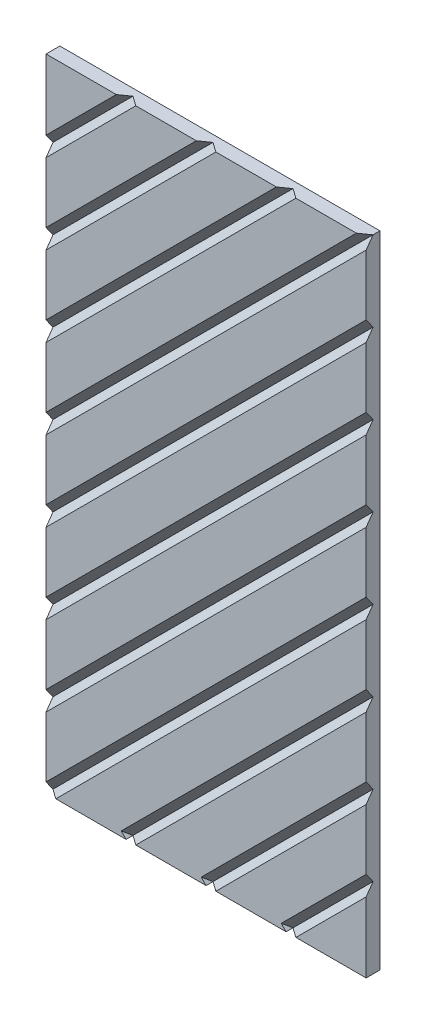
ISO-10303-21;
HEADER;
FILE_DESCRIPTION(('STEP AP214'),'2;1');
FILE_NAME('part.step','',(''),(''),'','','');
FILE_SCHEMA(('AUTOMOTIVE_DESIGN { 1 0 10303 214 1 1 1 1 }'));
ENDSEC;
DATA;
#1=APPLICATION_CONTEXT('core data for automotive mechanical design processes');
#2=APPLICATION_PROTOCOL_DEFINITION('international standard','automotive_design',2000,#1);
#3=PRODUCT_CONTEXT('',#1,'mechanical');
#4=PRODUCT('Part','Part','',(#3));
#5=PRODUCT_RELATED_PRODUCT_CATEGORY('part','',(#4));
#6=PRODUCT_DEFINITION_FORMATION('','',#4);
#7=PRODUCT_DEFINITION_CONTEXT('part definition',#1,'design');
#8=PRODUCT_DEFINITION('design','',#6,#7);
#9=PRODUCT_DEFINITION_SHAPE('','',#8);
#10=(LENGTH_UNIT() NAMED_UNIT(*) SI_UNIT(.MILLI.,.METRE.));
#11=(NAMED_UNIT(*) PLANE_ANGLE_UNIT() SI_UNIT($,.RADIAN.));
#12=(NAMED_UNIT(*) SI_UNIT($,.STERADIAN.) SOLID_ANGLE_UNIT());
#13=UNCERTAINTY_MEASURE_WITH_UNIT(LENGTH_MEASURE(1.E-05),#10,'distance_accuracy_value','');
#14=(GEOMETRIC_REPRESENTATION_CONTEXT(3) GLOBAL_UNCERTAINTY_ASSIGNED_CONTEXT((#13)) GLOBAL_UNIT_ASSIGNED_CONTEXT((#10,
#11,#12)) REPRESENTATION_CONTEXT('',''));
#15=CARTESIAN_POINT('',(0.,0.,0.));
#16=DIRECTION('',(0.,0.,1.));
#17=DIRECTION('',(1.,0.,0.));
#18=AXIS2_PLACEMENT_3D('',#15,#16,#17);
#19=CARTESIAN_POINT('',(0.,0.,25.));
#20=DIRECTION('',(0.,0.,1.));
#21=DIRECTION('',(1.,0.,0.));
#22=AXIS2_PLACEMENT_3D('',#19,#20,#21);
#23=PLANE('',#22);
#24=DIRECTION('',(0.707106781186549,0.707106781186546,0.));
#25=VECTOR('',#24,1.);
#26=CARTESIAN_POINT('',(371.338834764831,-371.338834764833,25.));
#27=LINE('',#26,#25);
#28=CARTESIAN_POINT('',(162.677669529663,-580.,25.));
#29=VERTEX_POINT('',#28);
#30=CARTESIAN_POINT('',(290.,-452.677669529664,25.));
#31=VERTEX_POINT('',#30);
#32=EDGE_CURVE('E299',#29,#31,#27,.T.);
#33=ORIENTED_EDGE('',*,*,#32,.F.);
#34=DIRECTION('',(1.,0.,0.));
#35=VECTOR('',#34,1.);
#36=CARTESIAN_POINT('',(-290.,-580.,25.));
#37=LINE('',#36,#35);
#38=CARTESIAN_POINT('',(290.,-580.,25.));
#39=VERTEX_POINT('',#38);
#40=EDGE_CURVE('E298',#29,#39,#37,.T.);
#41=ORIENTED_EDGE('',*,*,#40,.T.);
#42=DIRECTION('',(0.,1.,0.));
#43=VECTOR('',#42,1.);
#44=CARTESIAN_POINT('',(290.,580.,25.));
#45=LINE('',#44,#43);
#46=EDGE_CURVE('E467',#39,#31,#45,.T.);
#47=ORIENTED_EDGE('',*,*,#46,.T.);
#48=EDGE_LOOP('',(#33,#41,#47));
#49=FACE_BOUND('',#48,.T.);
#50=ADVANCED_FACE('F33',(#49),#23,.T.);
#51=DIRECTION('',(-0.707106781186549,-0.707106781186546,0.));
#52=VECTOR('',#51,1.);
#53=CARTESIAN_POINT('',(353.661165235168,-353.661165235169,25.));
#54=LINE('',#53,#52);
#55=CARTESIAN_POINT('',(290.,-417.322330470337,25.));
#56=VERTEX_POINT('',#55);
#57=CARTESIAN_POINT('',(136.161165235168,-571.161165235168,25.));
#58=VERTEX_POINT('',#57);
#59=EDGE_CURVE('E290',#56,#58,#54,.T.);
#60=ORIENTED_EDGE('',*,*,#59,.F.);
#61=CARTESIAN_POINT('',(290.,-307.677669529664,25.));
#62=VERTEX_POINT('',#61);
#63=EDGE_CURVE('E471',#56,#62,#45,.T.);
#64=ORIENTED_EDGE('',*,*,#63,.T.);
#65=DIRECTION('',(0.707106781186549,0.707106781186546,0.));
#66=VECTOR('',#65,1.);
#67=CARTESIAN_POINT('',(298.838834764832,-298.838834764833,25.));
#68=LINE('',#67,#66);
#69=CARTESIAN_POINT('',(17.6776695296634,-580.,25.));
#70=VERTEX_POINT('',#69);
#71=EDGE_CURVE('E310',#70,#62,#68,.T.);
#72=ORIENTED_EDGE('',*,*,#71,.F.);
#73=CARTESIAN_POINT('',(145.,-580.,25.));
#74=VERTEX_POINT('',#73);
#75=EDGE_CURVE('E558',#70,#74,#37,.T.);
#76=ORIENTED_EDGE('',*,*,#75,.T.);
#77=DIRECTION('',(-0.707106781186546,0.70710678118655,0.));
#78=VECTOR('',#77,1.);
#79=CARTESIAN_POINT('',(-217.5,-217.499999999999,25.));
#80=LINE('',#79,#78);
#81=EDGE_CURVE('E279',#74,#58,#80,.T.);
#82=ORIENTED_EDGE('',*,*,#81,.T.);
#83=EDGE_LOOP('',(#60,#64,#72,#76,#82));
#84=FACE_BOUND('',#83,.T.);
#85=ADVANCED_FACE('F665',(#84),#23,.T.);
#86=DIRECTION('',(-0.707106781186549,-0.707106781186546,0.));
#87=VECTOR('',#86,1.);
#88=CARTESIAN_POINT('',(281.161165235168,-281.161165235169,25.));
#89=LINE('',#88,#87);
#90=CARTESIAN_POINT('',(290.,-272.322330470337,25.));
#91=VERTEX_POINT('',#90);
#92=CARTESIAN_POINT('',(-8.83883476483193,-571.161165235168,25.));
#93=VERTEX_POINT('',#92);
#94=EDGE_CURVE('E308',#91,#93,#89,.T.);
#95=ORIENTED_EDGE('',*,*,#94,.F.);
#96=CARTESIAN_POINT('',(290.,-162.677669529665,25.));
#97=VERTEX_POINT('',#96);
#98=EDGE_CURVE('E636',#91,#97,#45,.T.);
#99=ORIENTED_EDGE('',*,*,#98,.T.);
#100=DIRECTION('',(0.707106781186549,0.707106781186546,0.));
#101=VECTOR('',#100,1.);
#102=CARTESIAN_POINT('',(226.338834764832,-226.338834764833,25.));
#103=LINE('',#102,#101);
#104=CARTESIAN_POINT('',(-127.322330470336,-580.,25.));
#105=VERTEX_POINT('',#104);
#106=EDGE_CURVE('E327',#105,#97,#103,.T.);
#107=ORIENTED_EDGE('',*,*,#106,.F.);
#108=CARTESIAN_POINT('',(-3.33066907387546E-13,-580.,25.));
#109=VERTEX_POINT('',#108);
#110=EDGE_CURVE('E466',#105,#109,#37,.T.);
#111=ORIENTED_EDGE('',*,*,#110,.T.);
#112=DIRECTION('',(-0.707106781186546,0.70710678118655,0.));
#113=VECTOR('',#112,1.);
#114=CARTESIAN_POINT('',(-290.,-289.999999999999,25.));
#115=LINE('',#114,#113);
#116=EDGE_CURVE('E316',#109,#93,#115,.T.);
#117=ORIENTED_EDGE('',*,*,#116,.T.);
#118=EDGE_LOOP('',(#95,#99,#107,#111,#117));
#119=FACE_BOUND('',#118,.T.);
#120=ADVANCED_FACE('F670',(#119),#23,.T.);
#121=DIRECTION('',(0.707106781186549,0.707106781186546,0.));
#122=VECTOR('',#121,1.);
#123=CARTESIAN_POINT('',(-353.661165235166,353.661165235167,25.));
#124=LINE('',#123,#122);
#125=CARTESIAN_POINT('',(-290.,417.322330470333,25.));
#126=VERTEX_POINT('',#125);
#127=CARTESIAN_POINT('',(-127.322330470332,580.,25.));
#128=VERTEX_POINT('',#127);
#129=EDGE_CURVE('E534',#126,#128,#124,.T.);
#130=ORIENTED_EDGE('',*,*,#129,.F.);
#131=DIRECTION('',(0.,-1.,0.));
#132=VECTOR('',#131,1.);
#133=CARTESIAN_POINT('',(-290.,580.,25.));
#134=LINE('',#133,#132);
#135=CARTESIAN_POINT('',(-290.,307.67766952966,25.));
#136=VERTEX_POINT('',#135);
#137=EDGE_CURVE('E460',#126,#136,#134,.T.);
#138=ORIENTED_EDGE('',*,*,#137,.T.);
#139=DIRECTION('',(-0.707106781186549,-0.707106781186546,0.));
#140=VECTOR('',#139,1.);
#141=CARTESIAN_POINT('',(-298.83883476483,298.838834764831,25.));
#142=LINE('',#141,#140);
#143=CARTESIAN_POINT('',(-17.6776695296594,580.,25.));
#144=VERTEX_POINT('',#143);
#145=EDGE_CURVE('E527',#144,#136,#142,.T.);
#146=ORIENTED_EDGE('',*,*,#145,.F.);
#147=DIRECTION('',(-1.,0.,0.));
#148=VECTOR('',#147,1.);
#149=CARTESIAN_POINT('',(-290.,580.,25.));
#150=LINE('',#149,#148);
#151=EDGE_CURVE('E577',#144,#128,#150,.T.);
#152=ORIENTED_EDGE('',*,*,#151,.T.);
#153=EDGE_LOOP('',(#130,#138,#146,#152));
#154=FACE_BOUND('',#153,.T.);
#155=ADVANCED_FACE('F898',(#154),#23,.T.);
#156=DIRECTION('',(0.707106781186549,0.707106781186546,0.));
#157=VECTOR('',#156,1.);
#158=CARTESIAN_POINT('',(-281.161165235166,281.161165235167,25.));
#159=LINE('',#158,#157);
#160=CARTESIAN_POINT('',(-290.,272.322330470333,25.));
#161=VERTEX_POINT('',#160);
#162=CARTESIAN_POINT('',(17.6776695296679,580.,25.));
#163=VERTEX_POINT('',#162);
#164=EDGE_CURVE('E530',#161,#163,#159,.T.);
#165=ORIENTED_EDGE('',*,*,#164,.F.);
#166=CARTESIAN_POINT('',(-290.,162.677669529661,25.));
#167=VERTEX_POINT('',#166);
#168=EDGE_CURVE('E595',#161,#167,#134,.T.);
#169=ORIENTED_EDGE('',*,*,#168,.T.);
#170=DIRECTION('',(-0.707106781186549,-0.707106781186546,0.));
#171=VECTOR('',#170,1.);
#172=CARTESIAN_POINT('',(-226.33883476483,226.338834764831,25.));
#173=LINE('',#172,#171);
#174=CARTESIAN_POINT('',(127.32233047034,580.,25.));
#175=VERTEX_POINT('',#174);
#176=EDGE_CURVE('E522',#175,#167,#173,.T.);
#177=ORIENTED_EDGE('',*,*,#176,.F.);
#178=EDGE_CURVE('E477',#175,#163,#150,.T.);
#179=ORIENTED_EDGE('',*,*,#178,.T.);
#180=EDGE_LOOP('',(#165,#169,#177,#179));
#181=FACE_BOUND('',#180,.T.);
#182=ADVANCED_FACE('F588',(#181),#23,.T.);
#183=DIRECTION('',(0.707106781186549,0.707106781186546,0.));
#184=VECTOR('',#183,1.);
#185=CARTESIAN_POINT('',(-208.661165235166,208.661165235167,25.));
#186=LINE('',#185,#184);
#187=CARTESIAN_POINT('',(-290.,127.322330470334,25.));
#188=VERTEX_POINT('',#187);
#189=CARTESIAN_POINT('',(162.677669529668,580.,25.));
#190=VERTEX_POINT('',#189);
#191=EDGE_CURVE('E525',#188,#190,#186,.T.);
#192=ORIENTED_EDGE('',*,*,#191,.F.);
#193=CARTESIAN_POINT('',(-290.,17.6776695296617,25.));
#194=VERTEX_POINT('',#193);
#195=EDGE_CURVE('E596',#188,#194,#134,.T.);
#196=ORIENTED_EDGE('',*,*,#195,.T.);
#197=DIRECTION('',(-0.707106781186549,-0.707106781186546,0.));
#198=VECTOR('',#197,1.);
#199=CARTESIAN_POINT('',(-153.83883476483,153.838834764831,25.));
#200=LINE('',#199,#198);
#201=CARTESIAN_POINT('',(272.32233047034,580.,25.));
#202=VERTEX_POINT('',#201);
#203=EDGE_CURVE('E517',#202,#194,#200,.T.);
#204=ORIENTED_EDGE('',*,*,#203,.F.);
#205=EDGE_CURVE('E473',#202,#190,#150,.T.);
#206=ORIENTED_EDGE('',*,*,#205,.T.);
#207=EDGE_LOOP('',(#192,#196,#204,#206));
#208=FACE_BOUND('',#207,.T.);
#209=ADVANCED_FACE('F696',(#208),#23,.T.);
#210=DIRECTION('',(0.707106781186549,0.707106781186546,0.));
#211=VECTOR('',#210,1.);
#212=CARTESIAN_POINT('',(-136.161165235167,136.161165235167,25.));
#213=LINE('',#212,#211);
#214=CARTESIAN_POINT('',(-290.,-17.6776695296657,25.));
#215=VERTEX_POINT('',#214);
#216=CARTESIAN_POINT('',(290.,562.322330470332,25.));
#217=VERTEX_POINT('',#216);
#218=EDGE_CURVE('E520',#215,#217,#213,.T.);
#219=ORIENTED_EDGE('',*,*,#218,.F.);
#220=CARTESIAN_POINT('',(-290.,-127.322330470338,25.));
#221=VERTEX_POINT('',#220);
#222=EDGE_CURVE('E597',#215,#221,#134,.T.);
#223=ORIENTED_EDGE('',*,*,#222,.T.);
#224=DIRECTION('',(-0.707106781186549,-0.707106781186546,0.));
#225=VECTOR('',#224,1.);
#226=CARTESIAN_POINT('',(-81.3388347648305,81.3388347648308,25.));
#227=LINE('',#226,#225);
#228=CARTESIAN_POINT('',(290.,452.67766952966,25.));
#229=VERTEX_POINT('',#228);
#230=EDGE_CURVE('E512',#229,#221,#227,.T.);
#231=ORIENTED_EDGE('',*,*,#230,.F.);
#232=EDGE_CURVE('E465',#229,#217,#45,.T.);
#233=ORIENTED_EDGE('',*,*,#232,.T.);
#234=EDGE_LOOP('',(#219,#223,#231,#233));
#235=FACE_BOUND('',#234,.T.);
#236=ADVANCED_FACE('F692',(#235),#23,.T.);
#237=DIRECTION('',(0.707106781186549,0.707106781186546,0.));
#238=VECTOR('',#237,1.);
#239=CARTESIAN_POINT('',(-63.6611652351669,63.6611652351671,25.));
#240=LINE('',#239,#238);
#241=CARTESIAN_POINT('',(-290.,-162.677669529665,25.));
#242=VERTEX_POINT('',#241);
#243=CARTESIAN_POINT('',(290.,417.322330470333,25.));
#244=VERTEX_POINT('',#243);
#245=EDGE_CURVE('E515',#242,#244,#240,.T.);
#246=ORIENTED_EDGE('',*,*,#245,.F.);
#247=CARTESIAN_POINT('',(-290.,-272.322330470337,25.));
#248=VERTEX_POINT('',#247);
#249=EDGE_CURVE('E602',#242,#248,#134,.T.);
#250=ORIENTED_EDGE('',*,*,#249,.T.);
#251=DIRECTION('',(-0.707106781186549,-0.707106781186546,0.));
#252=VECTOR('',#251,1.);
#253=CARTESIAN_POINT('',(-8.83883476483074,8.83883476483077,25.));
#254=LINE('',#253,#252);
#255=CARTESIAN_POINT('',(290.,307.67766952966,25.));
#256=VERTEX_POINT('',#255);
#257=EDGE_CURVE('E507',#256,#248,#254,.T.);
#258=ORIENTED_EDGE('',*,*,#257,.F.);
#259=EDGE_CURVE('E639',#256,#244,#45,.T.);
#260=ORIENTED_EDGE('',*,*,#259,.T.);
#261=EDGE_LOOP('',(#246,#250,#258,#260));
#262=FACE_BOUND('',#261,.T.);
#263=ADVANCED_FACE('F688',(#262),#23,.T.);
#264=DIRECTION('',(0.707106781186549,0.707106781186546,0.));
#265=VECTOR('',#264,1.);
#266=CARTESIAN_POINT('',(8.83883476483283,-8.83883476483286,25.));
#267=LINE('',#266,#265);
#268=CARTESIAN_POINT('',(-290.,-307.677669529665,25.));
#269=VERTEX_POINT('',#268);
#270=CARTESIAN_POINT('',(290.,272.322330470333,25.));
#271=VERTEX_POINT('',#270);
#272=EDGE_CURVE('E510',#269,#271,#267,.T.);
#273=ORIENTED_EDGE('',*,*,#272,.F.);
#274=CARTESIAN_POINT('',(-290.,-417.322330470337,25.));
#275=VERTEX_POINT('',#274);
#276=EDGE_CURVE('E607',#269,#275,#134,.T.);
#277=ORIENTED_EDGE('',*,*,#276,.T.);
#278=DIRECTION('',(-0.707106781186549,-0.707106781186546,0.));
#279=VECTOR('',#278,1.);
#280=CARTESIAN_POINT('',(63.661165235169,-63.6611652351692,25.));
#281=LINE('',#280,#279);
#282=CARTESIAN_POINT('',(290.,162.677669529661,25.));
#283=VERTEX_POINT('',#282);
#284=EDGE_CURVE('E502',#283,#275,#281,.T.);
#285=ORIENTED_EDGE('',*,*,#284,.F.);
#286=EDGE_CURVE('E637',#283,#271,#45,.T.);
#287=ORIENTED_EDGE('',*,*,#286,.T.);
#288=EDGE_LOOP('',(#273,#277,#285,#287));
#289=FACE_BOUND('',#288,.T.);
#290=ADVANCED_FACE('F645',(#289),#23,.T.);
#291=DIRECTION('',(0.707106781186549,0.707106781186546,0.));
#292=VECTOR('',#291,1.);
#293=CARTESIAN_POINT('',(81.3388347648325,-81.3388347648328,25.));
#294=LINE('',#293,#292);
#295=CARTESIAN_POINT('',(-290.,-452.677669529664,25.));
#296=VERTEX_POINT('',#295);
#297=CARTESIAN_POINT('',(290.,127.322330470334,25.));
#298=VERTEX_POINT('',#297);
#299=EDGE_CURVE('E505',#296,#298,#294,.T.);
#300=ORIENTED_EDGE('',*,*,#299,.F.);
#301=CARTESIAN_POINT('',(-290.,-562.322330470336,25.));
#302=VERTEX_POINT('',#301);
#303=EDGE_CURVE('E461',#296,#302,#134,.T.);
#304=ORIENTED_EDGE('',*,*,#303,.T.);
#305=DIRECTION('',(-0.707106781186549,-0.707106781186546,0.));
#306=VECTOR('',#305,1.);
#307=CARTESIAN_POINT('',(136.161165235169,-136.161165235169,25.));
#308=LINE('',#307,#306);
#309=CARTESIAN_POINT('',(290.,17.6776695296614,25.));
#310=VERTEX_POINT('',#309);
#311=EDGE_CURVE('E496',#310,#302,#308,.T.);
#312=ORIENTED_EDGE('',*,*,#311,.F.);
#313=EDGE_CURVE('E472',#310,#298,#45,.T.);
#314=ORIENTED_EDGE('',*,*,#313,.T.);
#315=EDGE_LOOP('',(#300,#304,#312,#314));
#316=FACE_BOUND('',#315,.T.);
#317=ADVANCED_FACE('F620',(#316),#23,.T.);
#318=DIRECTION('',(-0.707106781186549,-0.707106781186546,0.));
#319=VECTOR('',#318,1.);
#320=CARTESIAN_POINT('',(208.661165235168,-208.661165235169,25.));
#321=LINE('',#320,#319);
#322=CARTESIAN_POINT('',(290.,-127.322330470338,25.));
#323=VERTEX_POINT('',#322);
#324=CARTESIAN_POINT('',(-153.838834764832,-571.161165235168,25.));
#325=VERTEX_POINT('',#324);
#326=EDGE_CURVE('E325',#323,#325,#321,.T.);
#327=ORIENTED_EDGE('',*,*,#326,.F.);
#328=CARTESIAN_POINT('',(290.,-17.6776695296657,25.));
#329=VERTEX_POINT('',#328);
#330=EDGE_CURVE('E635',#323,#329,#45,.T.);
#331=ORIENTED_EDGE('',*,*,#330,.T.);
#332=DIRECTION('',(0.707106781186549,0.707106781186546,0.));
#333=VECTOR('',#332,1.);
#334=CARTESIAN_POINT('',(153.838834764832,-153.838834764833,25.));
#335=LINE('',#334,#333);
#336=CARTESIAN_POINT('',(-272.322330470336,-580.,25.));
#337=VERTEX_POINT('',#336);
#338=EDGE_CURVE('E499',#337,#329,#335,.T.);
#339=ORIENTED_EDGE('',*,*,#338,.F.);
#340=CARTESIAN_POINT('',(-145.,-580.,25.));
#341=VERTEX_POINT('',#340);
#342=EDGE_CURVE('E462',#337,#341,#37,.T.);
#343=ORIENTED_EDGE('',*,*,#342,.T.);
#344=DIRECTION('',(-0.707106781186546,0.70710678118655,0.));
#345=VECTOR('',#344,1.);
#346=CARTESIAN_POINT('',(-362.500000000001,-362.499999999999,25.));
#347=LINE('',#346,#345);
#348=EDGE_CURVE('E333',#341,#325,#347,.T.);
#349=ORIENTED_EDGE('',*,*,#348,.T.);
#350=EDGE_LOOP('',(#327,#331,#339,#343,#349));
#351=FACE_BOUND('',#350,.T.);
#352=ADVANCED_FACE('F633',(#351),#23,.T.);
#353=CARTESIAN_POINT('',(-290.,580.,25.));
#354=DIRECTION('',(1.,0.,0.));
#355=DIRECTION('',(0.,0.,-1.));
#356=AXIS2_PLACEMENT_3D('',#353,#354,#355);
#357=PLANE('',#356);
#358=ORIENTED_EDGE('',*,*,#137,.F.);
#359=DIRECTION('',(0.,0.816496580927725,-0.577350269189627));
#360=VECTOR('',#359,1.);
#361=CARTESIAN_POINT('',(-290.,525.774110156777,-51.6869888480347));
#362=LINE('',#361,#360);
#363=CARTESIAN_POINT('',(-290.,434.999999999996,12.5));
#364=VERTEX_POINT('',#363);
#365=EDGE_CURVE('E348',#126,#364,#362,.T.);
#366=ORIENTED_EDGE('',*,*,#365,.T.);
#367=DIRECTION('',(0.,0.816496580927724,0.577350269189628));
#368=VECTOR('',#367,1.);
#369=CARTESIAN_POINT('',(-290.,537.559223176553,85.0203221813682));
#370=LINE('',#369,#368);
#371=CARTESIAN_POINT('',(-290.,452.67766952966,25.));
#372=VERTEX_POINT('',#371);
#373=EDGE_CURVE('E342',#364,#372,#370,.T.);
#374=ORIENTED_EDGE('',*,*,#373,.T.);
#375=CARTESIAN_POINT('',(-290.,580.,25.));
#376=VERTEX_POINT('',#375);
#377=EDGE_CURVE('E457',#376,#372,#134,.T.);
#378=ORIENTED_EDGE('',*,*,#377,.F.);
#379=DIRECTION('',(0.,0.,-1.));
#380=VECTOR('',#379,1.);
#381=CARTESIAN_POINT('',(-290.,580.,25.));
#382=LINE('',#381,#380);
#383=CARTESIAN_POINT('',(-290.,580.,0.));
#384=VERTEX_POINT('',#383);
#385=EDGE_CURVE('E476',#376,#384,#382,.T.);
#386=ORIENTED_EDGE('',*,*,#385,.T.);
#387=DIRECTION('',(0.,-1.,0.));
#388=VECTOR('',#387,1.);
#389=CARTESIAN_POINT('',(-290.,580.,0.));
#390=LINE('',#389,#388);
#391=CARTESIAN_POINT('',(-290.,-580.,0.));
#392=VERTEX_POINT('',#391);
#393=EDGE_CURVE('E456',#384,#392,#390,.T.);
#394=ORIENTED_EDGE('',*,*,#393,.T.);
#395=DIRECTION('',(0.,0.,-1.));
#396=VECTOR('',#395,1.);
#397=CARTESIAN_POINT('',(-290.,-580.,25.));
#398=LINE('',#397,#396);
#399=CARTESIAN_POINT('',(-290.,-580.,12.5));
#400=VERTEX_POINT('',#399);
#401=EDGE_CURVE('E494',#400,#392,#398,.T.);
#402=ORIENTED_EDGE('',*,*,#401,.F.);
#403=DIRECTION('',(0.,0.816496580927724,0.577350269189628));
#404=VECTOR('',#403,1.);
#405=CARTESIAN_POINT('',(-290.,199.225889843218,563.495910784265));
#406=LINE('',#405,#404);
#407=EDGE_CURVE('E447',#400,#302,#406,.T.);
#408=ORIENTED_EDGE('',*,*,#407,.T.);
#409=ORIENTED_EDGE('',*,*,#303,.F.);
#410=DIRECTION('',(0.,0.816496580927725,-0.577350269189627));
#411=VECTOR('',#410,1.);
#412=CARTESIAN_POINT('',(-290.,235.774110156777,-461.808921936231));
#413=LINE('',#412,#411);
#414=CARTESIAN_POINT('',(-290.,-435.000000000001,12.5));
#415=VERTEX_POINT('',#414);
#416=EDGE_CURVE('E438',#296,#415,#413,.T.);
#417=ORIENTED_EDGE('',*,*,#416,.T.);
#418=DIRECTION('',(0.,0.816496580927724,0.577350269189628));
#419=VECTOR('',#418,1.);
#420=CARTESIAN_POINT('',(-290.,247.559223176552,495.142255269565));
#421=LINE('',#420,#419);
#422=EDGE_CURVE('E432',#415,#275,#421,.T.);
#423=ORIENTED_EDGE('',*,*,#422,.T.);
#424=ORIENTED_EDGE('',*,*,#276,.F.);
#425=DIRECTION('',(0.,0.816496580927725,-0.577350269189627));
#426=VECTOR('',#425,1.);
#427=CARTESIAN_POINT('',(-290.,284.10744349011,-393.455266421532));
#428=LINE('',#427,#426);
#429=CARTESIAN_POINT('',(-290.,-290.000000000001,12.5));
#430=VERTEX_POINT('',#429);
#431=EDGE_CURVE('E423',#269,#430,#428,.T.);
#432=ORIENTED_EDGE('',*,*,#431,.T.);
#433=DIRECTION('',(0.,0.816496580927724,0.577350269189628));
#434=VECTOR('',#433,1.);
#435=CARTESIAN_POINT('',(-290.,295.892556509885,426.788599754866));
#436=LINE('',#435,#434);
#437=EDGE_CURVE('E417',#430,#248,#436,.T.);
#438=ORIENTED_EDGE('',*,*,#437,.T.);
#439=ORIENTED_EDGE('',*,*,#249,.F.);
#440=DIRECTION('',(0.,0.816496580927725,-0.577350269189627));
#441=VECTOR('',#440,1.);
#442=CARTESIAN_POINT('',(-290.,332.440776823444,-325.101610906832));
#443=LINE('',#442,#441);
#444=CARTESIAN_POINT('',(-290.,-145.000000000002,12.5000000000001));
#445=VERTEX_POINT('',#444);
#446=EDGE_CURVE('E408',#242,#445,#443,.T.);
#447=ORIENTED_EDGE('',*,*,#446,.T.);
#448=DIRECTION('',(0.,0.816496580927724,0.577350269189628));
#449=VECTOR('',#448,1.);
#450=CARTESIAN_POINT('',(-290.,344.225889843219,358.434944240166));
#451=LINE('',#450,#449);
#452=EDGE_CURVE('E402',#445,#221,#451,.T.);
#453=ORIENTED_EDGE('',*,*,#452,.T.);
#454=ORIENTED_EDGE('',*,*,#222,.F.);
#455=DIRECTION('',(0.,0.816496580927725,-0.577350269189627));
#456=VECTOR('',#455,1.);
#457=CARTESIAN_POINT('',(-290.,380.774110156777,-256.747955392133));
#458=LINE('',#457,#456);
#459=CARTESIAN_POINT('',(-290.,-2.16493489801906E-12,12.5));
#460=VERTEX_POINT('',#459);
#461=EDGE_CURVE('E393',#215,#460,#458,.T.);
#462=ORIENTED_EDGE('',*,*,#461,.T.);
#463=DIRECTION('',(0.,0.816496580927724,0.577350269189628));
#464=VECTOR('',#463,1.);
#465=CARTESIAN_POINT('',(-290.,392.559223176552,290.081288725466));
#466=LINE('',#465,#464);
#467=EDGE_CURVE('E387',#460,#194,#466,.T.);
#468=ORIENTED_EDGE('',*,*,#467,.T.);
#469=ORIENTED_EDGE('',*,*,#195,.F.);
#470=DIRECTION('',(0.,0.816496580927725,-0.577350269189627));
#471=VECTOR('',#470,1.);
#472=CARTESIAN_POINT('',(-290.,429.107443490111,-188.394299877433));
#473=LINE('',#472,#471);
#474=CARTESIAN_POINT('',(-290.,144.999999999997,12.5));
#475=VERTEX_POINT('',#474);
#476=EDGE_CURVE('E378',#188,#475,#473,.T.);
#477=ORIENTED_EDGE('',*,*,#476,.T.);
#478=DIRECTION('',(0.,0.816496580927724,0.577350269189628));
#479=VECTOR('',#478,1.);
#480=CARTESIAN_POINT('',(-290.,440.892556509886,221.727633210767));
#481=LINE('',#480,#479);
#482=EDGE_CURVE('E372',#475,#167,#481,.T.);
#483=ORIENTED_EDGE('',*,*,#482,.T.);
#484=ORIENTED_EDGE('',*,*,#168,.F.);
#485=DIRECTION('',(0.,0.816496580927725,-0.577350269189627));
#486=VECTOR('',#485,1.);
#487=CARTESIAN_POINT('',(-290.,477.440776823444,-120.040644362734));
#488=LINE('',#487,#486);
#489=CARTESIAN_POINT('',(-290.,289.999999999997,12.5));
#490=VERTEX_POINT('',#489);
#491=EDGE_CURVE('E363',#161,#490,#488,.T.);
#492=ORIENTED_EDGE('',*,*,#491,.T.);
#493=DIRECTION('',(0.,0.816496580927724,0.577350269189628));
#494=VECTOR('',#493,1.);
#495=CARTESIAN_POINT('',(-290.,489.225889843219,153.373977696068));
#496=LINE('',#495,#494);
#497=EDGE_CURVE('E357',#490,#136,#496,.T.);
#498=ORIENTED_EDGE('',*,*,#497,.T.);
#499=EDGE_LOOP('',(#358,#366,#374,#378,#386,#394,#402,#408,#409,#417,#423,#424,#432,#438,#439,
#447,#453,#454,#462,#468,#469,#477,#483,#484,#492,#498));
#500=FACE_BOUND('',#499,.T.);
#501=ADVANCED_FACE('F35',(#500),#357,.F.);
#502=CARTESIAN_POINT('',(-290.,-580.,25.));
#503=DIRECTION('',(0.,1.,0.));
#504=DIRECTION('',(0.,0.,1.));
#505=AXIS2_PLACEMENT_3D('',#502,#503,#504);
#506=PLANE('',#505);
#507=ORIENTED_EDGE('',*,*,#40,.F.);
#508=DIRECTION('',(-0.816496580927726,0.,-0.577350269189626));
#509=VECTOR('',#508,1.);
#510=CARTESIAN_POINT('',(-139.107443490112,-580.,-188.394299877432));
#511=LINE('',#510,#509);
#512=CARTESIAN_POINT('',(145.,-580.,12.5));
#513=VERTEX_POINT('',#512);
#514=EDGE_CURVE('E286',#29,#513,#511,.T.);
#515=ORIENTED_EDGE('',*,*,#514,.T.);
#516=DIRECTION('',(0.,0.,-1.));
#517=VECTOR('',#516,1.);
#518=CARTESIAN_POINT('',(145.,-580.,25.0000000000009));
#519=LINE('',#518,#517);
#520=EDGE_CURVE('E11',#74,#513,#519,.T.);
#521=ORIENTED_EDGE('',*,*,#520,.F.);
#522=ORIENTED_EDGE('',*,*,#75,.F.);
#523=DIRECTION('',(-0.816496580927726,0.,-0.577350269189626));
#524=VECTOR('',#523,1.);
#525=CARTESIAN_POINT('',(-187.440776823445,-580.,-120.040644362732));
#526=LINE('',#525,#524);
#527=CARTESIAN_POINT('',(-1.11022302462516E-13,-580.,12.5));
#528=VERTEX_POINT('',#527);
#529=EDGE_CURVE('E313',#70,#528,#526,.T.);
#530=ORIENTED_EDGE('',*,*,#529,.T.);
#531=DIRECTION('',(0.,0.,-1.));
#532=VECTOR('',#531,1.);
#533=CARTESIAN_POINT('',(-3.33066907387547E-13,-580.,25.0000000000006));
#534=LINE('',#533,#532);
#535=EDGE_CURVE('E550',#109,#528,#534,.T.);
#536=ORIENTED_EDGE('',*,*,#535,.F.);
#537=ORIENTED_EDGE('',*,*,#110,.F.);
#538=DIRECTION('',(-0.816496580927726,0.,-0.577350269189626));
#539=VECTOR('',#538,1.);
#540=CARTESIAN_POINT('',(-235.774110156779,-580.,-51.6869888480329));
#541=LINE('',#540,#539);
#542=CARTESIAN_POINT('',(-145.,-580.,12.5));
#543=VERTEX_POINT('',#542);
#544=EDGE_CURVE('E330',#105,#543,#541,.T.);
#545=ORIENTED_EDGE('',*,*,#544,.T.);
#546=DIRECTION('',(0.,0.,-1.));
#547=VECTOR('',#546,1.);
#548=CARTESIAN_POINT('',(-145.,-580.,25.0000000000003));
#549=LINE('',#548,#547);
#550=EDGE_CURVE('E542',#341,#543,#549,.T.);
#551=ORIENTED_EDGE('',*,*,#550,.F.);
#552=ORIENTED_EDGE('',*,*,#342,.F.);
#553=DIRECTION('',(-0.816496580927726,0.,-0.577350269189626));
#554=VECTOR('',#553,1.);
#555=CARTESIAN_POINT('',(-284.107443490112,-580.,16.6666666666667));
#556=LINE('',#555,#554);
#557=EDGE_CURVE('E453',#337,#400,#556,.T.);
#558=ORIENTED_EDGE('',*,*,#557,.T.);
#559=ORIENTED_EDGE('',*,*,#401,.T.);
#560=DIRECTION('',(1.,0.,0.));
#561=VECTOR('',#560,1.);
#562=CARTESIAN_POINT('',(-290.,-580.,0.));
#563=LINE('',#562,#561);
#564=CARTESIAN_POINT('',(290.,-580.,0.));
#565=VERTEX_POINT('',#564);
#566=EDGE_CURVE('E480',#392,#565,#563,.T.);
#567=ORIENTED_EDGE('',*,*,#566,.T.);
#568=DIRECTION('',(0.,0.,-1.));
#569=VECTOR('',#568,1.);
#570=CARTESIAN_POINT('',(290.,-580.,25.));
#571=LINE('',#570,#569);
#572=EDGE_CURVE('E491',#39,#565,#571,.T.);
#573=ORIENTED_EDGE('',*,*,#572,.F.);
#574=EDGE_LOOP('',(#507,#515,#521,#522,#530,#536,#537,#545,#551,#552,#558,#559,#567,#573));
#575=FACE_BOUND('',#574,.T.);
#576=ADVANCED_FACE('F296',(#575),#506,.F.);
#577=CARTESIAN_POINT('',(290.,580.,25.));
#578=DIRECTION('',(-1.,0.,0.));
#579=DIRECTION('',(0.,0.,1.));
#580=AXIS2_PLACEMENT_3D('',#577,#578,#579);
#581=PLANE('',#580);
#582=DIRECTION('',(0.,-0.816496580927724,-0.577350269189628));
#583=VECTOR('',#582,1.);
#584=CARTESIAN_POINT('',(290.,247.559223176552,495.142255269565));
#585=LINE('',#584,#583);
#586=CARTESIAN_POINT('',(290.,-435.,12.5));
#587=VERTEX_POINT('',#586);
#588=EDGE_CURVE('E552',#56,#587,#585,.T.);
#589=ORIENTED_EDGE('',*,*,#588,.T.);
#590=DIRECTION('',(0.,-0.816496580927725,0.577350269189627));
#591=VECTOR('',#590,1.);
#592=CARTESIAN_POINT('',(290.,235.774110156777,-461.808921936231));
#593=LINE('',#592,#591);
#594=EDGE_CURVE('E41',#587,#31,#593,.T.);
#595=ORIENTED_EDGE('',*,*,#594,.T.);
#596=ORIENTED_EDGE('',*,*,#46,.F.);
#597=ORIENTED_EDGE('',*,*,#572,.T.);
#598=DIRECTION('',(0.,1.,0.));
#599=VECTOR('',#598,1.);
#600=CARTESIAN_POINT('',(290.,580.,0.));
#601=LINE('',#600,#599);
#602=CARTESIAN_POINT('',(290.,580.,0.));
#603=VERTEX_POINT('',#602);
#604=EDGE_CURVE('E482',#565,#603,#601,.T.);
#605=ORIENTED_EDGE('',*,*,#604,.T.);
#606=DIRECTION('',(0.,0.,-1.));
#607=VECTOR('',#606,1.);
#608=CARTESIAN_POINT('',(290.,580.,25.));
#609=LINE('',#608,#607);
#610=CARTESIAN_POINT('',(290.000000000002,579.999999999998,12.5));
#611=VERTEX_POINT('',#610);
#612=EDGE_CURVE('E489',#611,#603,#609,.T.);
#613=ORIENTED_EDGE('',*,*,#612,.F.);
#614=DIRECTION('',(0.,-0.816496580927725,0.577350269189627));
#615=VECTOR('',#614,1.);
#616=CARTESIAN_POINT('',(290.,574.107443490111,16.6666666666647));
#617=LINE('',#616,#615);
#618=EDGE_CURVE('E390',#611,#217,#617,.T.);
#619=ORIENTED_EDGE('',*,*,#618,.T.);
#620=ORIENTED_EDGE('',*,*,#232,.F.);
#621=DIRECTION('',(0.,-0.816496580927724,-0.577350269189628));
#622=VECTOR('',#621,1.);
#623=CARTESIAN_POINT('',(290.,537.559223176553,85.020322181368));
#624=LINE('',#623,#622);
#625=CARTESIAN_POINT('',(290.,434.999999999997,12.5));
#626=VERTEX_POINT('',#625);
#627=EDGE_CURVE('E399',#229,#626,#624,.T.);
#628=ORIENTED_EDGE('',*,*,#627,.T.);
#629=DIRECTION('',(0.,-0.816496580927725,0.577350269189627));
#630=VECTOR('',#629,1.);
#631=CARTESIAN_POINT('',(290.,525.774110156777,-51.6869888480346));
#632=LINE('',#631,#630);
#633=EDGE_CURVE('E405',#626,#244,#632,.T.);
#634=ORIENTED_EDGE('',*,*,#633,.T.);
#635=ORIENTED_EDGE('',*,*,#259,.F.);
#636=DIRECTION('',(0.,-0.816496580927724,-0.577350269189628));
#637=VECTOR('',#636,1.);
#638=CARTESIAN_POINT('',(290.,489.225889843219,153.373977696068));
#639=LINE('',#638,#637);
#640=CARTESIAN_POINT('',(290.,289.999999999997,12.5));
#641=VERTEX_POINT('',#640);
#642=EDGE_CURVE('E414',#256,#641,#639,.T.);
#643=ORIENTED_EDGE('',*,*,#642,.T.);
#644=DIRECTION('',(0.,-0.816496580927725,0.577350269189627));
#645=VECTOR('',#644,1.);
#646=CARTESIAN_POINT('',(290.,477.440776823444,-120.040644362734));
#647=LINE('',#646,#645);
#648=EDGE_CURVE('E420',#641,#271,#647,.T.);
#649=ORIENTED_EDGE('',*,*,#648,.T.);
#650=ORIENTED_EDGE('',*,*,#286,.F.);
#651=DIRECTION('',(0.,-0.816496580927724,-0.577350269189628));
#652=VECTOR('',#651,1.);
#653=CARTESIAN_POINT('',(290.,440.892556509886,221.727633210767));
#654=LINE('',#653,#652);
#655=CARTESIAN_POINT('',(290.,144.999999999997,12.5));
#656=VERTEX_POINT('',#655);
#657=EDGE_CURVE('E429',#283,#656,#654,.T.);
#658=ORIENTED_EDGE('',*,*,#657,.T.);
#659=DIRECTION('',(0.,-0.816496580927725,0.577350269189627));
#660=VECTOR('',#659,1.);
#661=CARTESIAN_POINT('',(290.,429.107443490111,-188.394299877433));
#662=LINE('',#661,#660);
#663=EDGE_CURVE('E435',#656,#298,#662,.T.);
#664=ORIENTED_EDGE('',*,*,#663,.T.);
#665=ORIENTED_EDGE('',*,*,#313,.F.);
#666=DIRECTION('',(0.,-0.816496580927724,-0.577350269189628));
#667=VECTOR('',#666,1.);
#668=CARTESIAN_POINT('',(290.,392.559223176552,290.081288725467));
#669=LINE('',#668,#667);
#670=CARTESIAN_POINT('',(290.,-2.02615701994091E-12,12.5));
#671=VERTEX_POINT('',#670);
#672=EDGE_CURVE('E444',#310,#671,#669,.T.);
#673=ORIENTED_EDGE('',*,*,#672,.T.);
#674=DIRECTION('',(0.,-0.816496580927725,0.577350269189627));
#675=VECTOR('',#674,1.);
#676=CARTESIAN_POINT('',(290.,380.774110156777,-256.747955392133));
#677=LINE('',#676,#675);
#678=EDGE_CURVE('E450',#671,#329,#677,.T.);
#679=ORIENTED_EDGE('',*,*,#678,.T.);
#680=ORIENTED_EDGE('',*,*,#330,.F.);
#681=DIRECTION('',(0.,-0.816496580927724,-0.577350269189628));
#682=VECTOR('',#681,1.);
#683=CARTESIAN_POINT('',(290.,344.225889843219,358.434944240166));
#684=LINE('',#683,#682);
#685=CARTESIAN_POINT('',(290.,-145.000000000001,12.5));
#686=VERTEX_POINT('',#685);
#687=EDGE_CURVE('E536',#323,#686,#684,.T.);
#688=ORIENTED_EDGE('',*,*,#687,.T.);
#689=DIRECTION('',(0.,-0.816496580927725,0.577350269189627));
#690=VECTOR('',#689,1.);
#691=CARTESIAN_POINT('',(290.,332.440776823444,-325.101610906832));
#692=LINE('',#691,#690);
#693=EDGE_CURVE('E539',#686,#97,#692,.T.);
#694=ORIENTED_EDGE('',*,*,#693,.T.);
#695=ORIENTED_EDGE('',*,*,#98,.F.);
#696=DIRECTION('',(0.,-0.816496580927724,-0.577350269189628));
#697=VECTOR('',#696,1.);
#698=CARTESIAN_POINT('',(290.,295.892556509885,426.788599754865));
#699=LINE('',#698,#697);
#700=CARTESIAN_POINT('',(290.,-290.000000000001,12.5));
#701=VERTEX_POINT('',#700);
#702=EDGE_CURVE('E544',#91,#701,#699,.T.);
#703=ORIENTED_EDGE('',*,*,#702,.T.);
#704=DIRECTION('',(0.,-0.816496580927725,0.577350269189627));
#705=VECTOR('',#704,1.);
#706=CARTESIAN_POINT('',(290.,284.107443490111,-393.455266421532));
#707=LINE('',#706,#705);
#708=EDGE_CURVE('E547',#701,#62,#707,.T.);
#709=ORIENTED_EDGE('',*,*,#708,.T.);
#710=ORIENTED_EDGE('',*,*,#63,.F.);
#711=EDGE_LOOP('',(#589,#595,#596,#597,#605,#613,#619,#620,#628,#634,#635,#643,#649,#650,#658,
#664,#665,#673,#679,#680,#688,#694,#695,#703,#709,#710));
#712=FACE_BOUND('',#711,.T.);
#713=ADVANCED_FACE('F555',(#712),#581,.F.);
#714=CARTESIAN_POINT('',(-290.,580.,25.));
#715=DIRECTION('',(0.,-1.,0.));
#716=DIRECTION('',(0.,0.,-1.));
#717=AXIS2_PLACEMENT_3D('',#714,#715,#716);
#718=PLANE('',#717);
#719=DIRECTION('',(0.816496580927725,0.,-0.577350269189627));
#720=VECTOR('',#719,1.);
#721=CARTESIAN_POINT('',(-247.559223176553,580.,85.0203221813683));
#722=LINE('',#721,#720);
#723=CARTESIAN_POINT('',(-162.677669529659,580.,25.));
#724=VERTEX_POINT('',#723);
#725=CARTESIAN_POINT('',(-144.999999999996,580.,12.5));
#726=VERTEX_POINT('',#725);
#727=EDGE_CURVE('E339',#724,#726,#722,.T.);
#728=ORIENTED_EDGE('',*,*,#727,.T.);
#729=DIRECTION('',(0.816496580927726,0.,0.577350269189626));
#730=VECTOR('',#729,1.);
#731=CARTESIAN_POINT('',(-235.774110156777,580.,-51.6869888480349));
#732=LINE('',#731,#730);
#733=EDGE_CURVE('E345',#726,#128,#732,.T.);
#734=ORIENTED_EDGE('',*,*,#733,.T.);
#735=ORIENTED_EDGE('',*,*,#151,.F.);
#736=DIRECTION('',(0.816496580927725,0.,-0.577350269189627));
#737=VECTOR('',#736,1.);
#738=CARTESIAN_POINT('',(-199.225889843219,580.,153.373977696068));
#739=LINE('',#738,#737);
#740=CARTESIAN_POINT('',(4.28823643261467E-12,580.,12.5));
#741=VERTEX_POINT('',#740);
#742=EDGE_CURVE('E354',#144,#741,#739,.T.);
#743=ORIENTED_EDGE('',*,*,#742,.T.);
#744=DIRECTION('',(0.816496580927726,0.,0.577350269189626));
#745=VECTOR('',#744,1.);
#746=CARTESIAN_POINT('',(-187.440776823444,580.,-120.040644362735));
#747=LINE('',#746,#745);
#748=EDGE_CURVE('E360',#741,#163,#747,.T.);
#749=ORIENTED_EDGE('',*,*,#748,.T.);
#750=ORIENTED_EDGE('',*,*,#178,.F.);
#751=DIRECTION('',(0.816496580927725,0.,-0.577350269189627));
#752=VECTOR('',#751,1.);
#753=CARTESIAN_POINT('',(-150.892556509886,580.,221.727633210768));
#754=LINE('',#753,#752);
#755=CARTESIAN_POINT('',(145.000000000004,580.,12.5));
#756=VERTEX_POINT('',#755);
#757=EDGE_CURVE('E369',#175,#756,#754,.T.);
#758=ORIENTED_EDGE('',*,*,#757,.T.);
#759=DIRECTION('',(0.816496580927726,0.,0.577350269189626));
#760=VECTOR('',#759,1.);
#761=CARTESIAN_POINT('',(-139.107443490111,580.,-188.394299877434));
#762=LINE('',#761,#760);
#763=EDGE_CURVE('E375',#756,#190,#762,.T.);
#764=ORIENTED_EDGE('',*,*,#763,.T.);
#765=ORIENTED_EDGE('',*,*,#205,.F.);
#766=DIRECTION('',(0.816496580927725,0.,-0.577350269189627));
#767=VECTOR('',#766,1.);
#768=CARTESIAN_POINT('',(-102.559223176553,580.,290.081288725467));
#769=LINE('',#768,#767);
#770=EDGE_CURVE('E384',#202,#611,#769,.T.);
#771=ORIENTED_EDGE('',*,*,#770,.T.);
#772=ORIENTED_EDGE('',*,*,#612,.T.);
#773=DIRECTION('',(-1.,0.,0.));
#774=VECTOR('',#773,1.);
#775=CARTESIAN_POINT('',(-290.,580.,0.));
#776=LINE('',#775,#774);
#777=EDGE_CURVE('E485',#603,#384,#776,.T.);
#778=ORIENTED_EDGE('',*,*,#777,.T.);
#779=ORIENTED_EDGE('',*,*,#385,.F.);
#780=EDGE_CURVE('E470',#724,#376,#150,.T.);
#781=ORIENTED_EDGE('',*,*,#780,.F.);
#782=EDGE_LOOP('',(#728,#734,#735,#743,#749,#750,#758,#764,#765,#771,#772,#778,#779,#781));
#783=FACE_BOUND('',#782,.T.);
#784=ADVANCED_FACE('F568',(#783),#718,.F.);
#785=DIRECTION('',(-0.707106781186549,-0.707106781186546,0.));
#786=VECTOR('',#785,1.);
#787=CARTESIAN_POINT('',(-371.338834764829,371.338834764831,25.));
#788=LINE('',#787,#786);
#789=EDGE_CURVE('E532',#724,#372,#788,.T.);
#790=ORIENTED_EDGE('',*,*,#789,.F.);
#791=ORIENTED_EDGE('',*,*,#780,.T.);
#792=ORIENTED_EDGE('',*,*,#377,.T.);
#793=EDGE_LOOP('',(#790,#791,#792));
#794=FACE_BOUND('',#793,.T.);
#795=ADVANCED_FACE('F576',(#794),#23,.T.);
#796=CARTESIAN_POINT('',(0.,0.,0.));
#797=DIRECTION('',(0.,0.,1.));
#798=DIRECTION('',(1.,0.,0.));
#799=AXIS2_PLACEMENT_3D('',#796,#797,#798);
#800=PLANE('',#799);
#801=ORIENTED_EDGE('',*,*,#393,.F.);
#802=ORIENTED_EDGE('',*,*,#777,.F.);
#803=ORIENTED_EDGE('',*,*,#604,.F.);
#804=ORIENTED_EDGE('',*,*,#566,.F.);
#805=EDGE_LOOP('',(#801,#802,#803,#804));
#806=FACE_BOUND('',#805,.T.);
#807=ADVANCED_FACE('F565',(#806),#800,.F.);
#808=CARTESIAN_POINT('',(599.358108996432,270.641891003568,39.8765002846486));
#809=DIRECTION('',(0.499999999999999,-0.500000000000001,-0.707106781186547));
#810=DIRECTION('',(0.,0.816496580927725,-0.577350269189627));
#811=AXIS2_PLACEMENT_3D('',#808,#809,#810);
#812=PLANE('',#811);
#813=ORIENTED_EDGE('',*,*,#338,.T.);
#814=ORIENTED_EDGE('',*,*,#678,.F.);
#815=DIRECTION('',(-0.707106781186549,-0.707106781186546,0.));
#816=VECTOR('',#815,1.);
#817=CARTESIAN_POINT('',(580.000000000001,289.999999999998,12.5));
#818=LINE('',#817,#816);
#819=EDGE_CURVE('E441',#671,#400,#818,.T.);
#820=ORIENTED_EDGE('',*,*,#819,.T.);
#821=ORIENTED_EDGE('',*,*,#557,.F.);
#822=EDGE_LOOP('',(#813,#814,#820,#821));
#823=FACE_BOUND('',#822,.T.);
#824=ADVANCED_FACE('F630',(#823),#812,.F.);
#825=CARTESIAN_POINT('',(580.000000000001,289.999999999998,12.5));
#826=DIRECTION('',(-0.5,0.500000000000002,-0.707106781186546));
#827=DIRECTION('',(0.,0.816496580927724,0.577350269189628));
#828=AXIS2_PLACEMENT_3D('',#825,#826,#827);
#829=PLANE('',#828);
#830=ORIENTED_EDGE('',*,*,#819,.F.);
#831=ORIENTED_EDGE('',*,*,#672,.F.);
#832=ORIENTED_EDGE('',*,*,#311,.T.);
#833=ORIENTED_EDGE('',*,*,#407,.F.);
#834=EDGE_LOOP('',(#830,#831,#832,#833));
#835=FACE_BOUND('',#834,.T.);
#836=ADVANCED_FACE('F625',(#835),#829,.F.);
#837=CARTESIAN_POINT('',(526.858108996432,343.141891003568,39.8765002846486));
#838=DIRECTION('',(0.5,-0.500000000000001,-0.707106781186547));
#839=DIRECTION('',(0.,0.816496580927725,-0.577350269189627));
#840=AXIS2_PLACEMENT_3D('',#837,#838,#839);
#841=PLANE('',#840);
#842=ORIENTED_EDGE('',*,*,#299,.T.);
#843=ORIENTED_EDGE('',*,*,#663,.F.);
#844=DIRECTION('',(-0.707106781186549,-0.707106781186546,0.));
#845=VECTOR('',#844,1.);
#846=CARTESIAN_POINT('',(507.500000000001,362.499999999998,12.5));
#847=LINE('',#846,#845);
#848=EDGE_CURVE('E426',#656,#415,#847,.T.);
#849=ORIENTED_EDGE('',*,*,#848,.T.);
#850=ORIENTED_EDGE('',*,*,#416,.F.);
#851=EDGE_LOOP('',(#842,#843,#849,#850));
#852=FACE_BOUND('',#851,.T.);
#853=ADVANCED_FACE('F655',(#852),#841,.F.);
#854=CARTESIAN_POINT('',(507.500000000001,362.499999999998,12.5));
#855=DIRECTION('',(-0.5,0.500000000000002,-0.707106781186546));
#856=DIRECTION('',(0.,0.816496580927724,0.577350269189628));
#857=AXIS2_PLACEMENT_3D('',#854,#855,#856);
#858=PLANE('',#857);
#859=ORIENTED_EDGE('',*,*,#848,.F.);
#860=ORIENTED_EDGE('',*,*,#657,.F.);
#861=ORIENTED_EDGE('',*,*,#284,.T.);
#862=ORIENTED_EDGE('',*,*,#422,.F.);
#863=EDGE_LOOP('',(#859,#860,#861,#862));
#864=FACE_BOUND('',#863,.T.);
#865=ADVANCED_FACE('F653',(#864),#858,.F.);
#866=CARTESIAN_POINT('',(454.358108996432,415.641891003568,39.8765002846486));
#867=DIRECTION('',(0.5,-0.500000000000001,-0.707106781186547));
#868=DIRECTION('',(0.,0.816496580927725,-0.577350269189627));
#869=AXIS2_PLACEMENT_3D('',#866,#867,#868);
#870=PLANE('',#869);
#871=ORIENTED_EDGE('',*,*,#272,.T.);
#872=ORIENTED_EDGE('',*,*,#648,.F.);
#873=DIRECTION('',(-0.707106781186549,-0.707106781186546,0.));
#874=VECTOR('',#873,1.);
#875=CARTESIAN_POINT('',(435.000000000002,434.999999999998,12.5));
#876=LINE('',#875,#874);
#877=EDGE_CURVE('E411',#641,#430,#876,.T.);
#878=ORIENTED_EDGE('',*,*,#877,.T.);
#879=ORIENTED_EDGE('',*,*,#431,.F.);
#880=EDGE_LOOP('',(#871,#872,#878,#879));
#881=FACE_BOUND('',#880,.T.);
#882=ADVANCED_FACE('F648',(#881),#870,.F.);
#883=CARTESIAN_POINT('',(435.000000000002,434.999999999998,12.5));
#884=DIRECTION('',(-0.5,0.500000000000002,-0.707106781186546));
#885=DIRECTION('',(0.,0.816496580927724,0.577350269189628));
#886=AXIS2_PLACEMENT_3D('',#883,#884,#885);
#887=PLANE('',#886);
#888=ORIENTED_EDGE('',*,*,#877,.F.);
#889=ORIENTED_EDGE('',*,*,#642,.F.);
#890=ORIENTED_EDGE('',*,*,#257,.T.);
#891=ORIENTED_EDGE('',*,*,#437,.F.);
#892=EDGE_LOOP('',(#888,#889,#890,#891));
#893=FACE_BOUND('',#892,.T.);
#894=ADVANCED_FACE('F650',(#893),#887,.F.);
#895=CARTESIAN_POINT('',(381.858108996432,488.141891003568,39.8765002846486));
#896=DIRECTION('',(0.5,-0.500000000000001,-0.707106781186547));
#897=DIRECTION('',(0.,0.816496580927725,-0.577350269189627));
#898=AXIS2_PLACEMENT_3D('',#895,#896,#897);
#899=PLANE('',#898);
#900=ORIENTED_EDGE('',*,*,#245,.T.);
#901=ORIENTED_EDGE('',*,*,#633,.F.);
#902=DIRECTION('',(-0.707106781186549,-0.707106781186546,0.));
#903=VECTOR('',#902,1.);
#904=CARTESIAN_POINT('',(362.500000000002,507.499999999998,12.5));
#905=LINE('',#904,#903);
#906=EDGE_CURVE('E396',#626,#445,#905,.T.);
#907=ORIENTED_EDGE('',*,*,#906,.T.);
#908=ORIENTED_EDGE('',*,*,#446,.F.);
#909=EDGE_LOOP('',(#900,#901,#907,#908));
#910=FACE_BOUND('',#909,.T.);
#911=ADVANCED_FACE('F698',(#910),#899,.F.);
#912=CARTESIAN_POINT('',(362.500000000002,507.499999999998,12.5));
#913=DIRECTION('',(-0.5,0.500000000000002,-0.707106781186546));
#914=DIRECTION('',(0.,0.816496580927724,0.577350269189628));
#915=AXIS2_PLACEMENT_3D('',#912,#913,#914);
#916=PLANE('',#915);
#917=ORIENTED_EDGE('',*,*,#906,.F.);
#918=ORIENTED_EDGE('',*,*,#627,.F.);
#919=ORIENTED_EDGE('',*,*,#230,.T.);
#920=ORIENTED_EDGE('',*,*,#452,.F.);
#921=EDGE_LOOP('',(#917,#918,#919,#920));
#922=FACE_BOUND('',#921,.T.);
#923=ADVANCED_FACE('F701',(#922),#916,.F.);
#924=CARTESIAN_POINT('',(309.358108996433,560.641891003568,39.8765002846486));
#925=DIRECTION('',(0.5,-0.500000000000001,-0.707106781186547));
#926=DIRECTION('',(0.,0.816496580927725,-0.577350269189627));
#927=AXIS2_PLACEMENT_3D('',#924,#925,#926);
#928=PLANE('',#927);
#929=ORIENTED_EDGE('',*,*,#218,.T.);
#930=ORIENTED_EDGE('',*,*,#618,.F.);
#931=DIRECTION('',(-0.707106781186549,-0.707106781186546,0.));
#932=VECTOR('',#931,1.);
#933=CARTESIAN_POINT('',(290.000000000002,579.999999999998,12.5));
#934=LINE('',#933,#932);
#935=EDGE_CURVE('E381',#611,#460,#934,.T.);
#936=ORIENTED_EDGE('',*,*,#935,.T.);
#937=ORIENTED_EDGE('',*,*,#461,.F.);
#938=EDGE_LOOP('',(#929,#930,#936,#937));
#939=FACE_BOUND('',#938,.T.);
#940=ADVANCED_FACE('F703',(#939),#928,.F.);
#941=CARTESIAN_POINT('',(290.000000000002,579.999999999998,12.5));
#942=DIRECTION('',(-0.5,0.500000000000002,-0.707106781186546));
#943=DIRECTION('',(0.,0.816496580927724,0.577350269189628));
#944=AXIS2_PLACEMENT_3D('',#941,#942,#943);
#945=PLANE('',#944);
#946=ORIENTED_EDGE('',*,*,#935,.F.);
#947=ORIENTED_EDGE('',*,*,#770,.F.);
#948=ORIENTED_EDGE('',*,*,#203,.T.);
#949=ORIENTED_EDGE('',*,*,#467,.F.);
#950=EDGE_LOOP('',(#946,#947,#948,#949));
#951=FACE_BOUND('',#950,.T.);
#952=ADVANCED_FACE('F706',(#951),#945,.F.);
#953=CARTESIAN_POINT('',(236.858108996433,633.141891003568,39.8765002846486));
#954=DIRECTION('',(0.5,-0.500000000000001,-0.707106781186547));
#955=DIRECTION('',(0.,0.816496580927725,-0.577350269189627));
#956=AXIS2_PLACEMENT_3D('',#953,#954,#955);
#957=PLANE('',#956);
#958=ORIENTED_EDGE('',*,*,#191,.T.);
#959=ORIENTED_EDGE('',*,*,#763,.F.);
#960=DIRECTION('',(-0.707106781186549,-0.707106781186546,0.));
#961=VECTOR('',#960,1.);
#962=CARTESIAN_POINT('',(217.500000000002,652.499999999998,12.5));
#963=LINE('',#962,#961);
#964=EDGE_CURVE('E366',#756,#475,#963,.T.);
#965=ORIENTED_EDGE('',*,*,#964,.T.);
#966=ORIENTED_EDGE('',*,*,#476,.F.);
#967=EDGE_LOOP('',(#958,#959,#965,#966));
#968=FACE_BOUND('',#967,.T.);
#969=ADVANCED_FACE('F709',(#968),#957,.F.);
#970=CARTESIAN_POINT('',(217.500000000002,652.499999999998,12.5));
#971=DIRECTION('',(-0.5,0.500000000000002,-0.707106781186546));
#972=DIRECTION('',(0.,0.816496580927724,0.577350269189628));
#973=AXIS2_PLACEMENT_3D('',#970,#971,#972);
#974=PLANE('',#973);
#975=ORIENTED_EDGE('',*,*,#964,.F.);
#976=ORIENTED_EDGE('',*,*,#757,.F.);
#977=ORIENTED_EDGE('',*,*,#176,.T.);
#978=ORIENTED_EDGE('',*,*,#482,.F.);
#979=EDGE_LOOP('',(#975,#976,#977,#978));
#980=FACE_BOUND('',#979,.T.);
#981=ADVANCED_FACE('F712',(#980),#974,.F.);
#982=CARTESIAN_POINT('',(164.358108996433,705.641891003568,39.8765002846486));
#983=DIRECTION('',(0.5,-0.500000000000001,-0.707106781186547));
#984=DIRECTION('',(0.,0.816496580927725,-0.577350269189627));
#985=AXIS2_PLACEMENT_3D('',#982,#983,#984);
#986=PLANE('',#985);
#987=ORIENTED_EDGE('',*,*,#164,.T.);
#988=ORIENTED_EDGE('',*,*,#748,.F.);
#989=DIRECTION('',(-0.707106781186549,-0.707106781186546,0.));
#990=VECTOR('',#989,1.);
#991=CARTESIAN_POINT('',(145.000000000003,724.999999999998,12.5));
#992=LINE('',#991,#990);
#993=EDGE_CURVE('E351',#741,#490,#992,.T.);
#994=ORIENTED_EDGE('',*,*,#993,.T.);
#995=ORIENTED_EDGE('',*,*,#491,.F.);
#996=EDGE_LOOP('',(#987,#988,#994,#995));
#997=FACE_BOUND('',#996,.T.);
#998=ADVANCED_FACE('F592',(#997),#986,.F.);
#999=CARTESIAN_POINT('',(145.000000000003,724.999999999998,12.5));
#1000=DIRECTION('',(-0.5,0.500000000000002,-0.707106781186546));
#1001=DIRECTION('',(0.,0.816496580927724,0.577350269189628));
#1002=AXIS2_PLACEMENT_3D('',#999,#1000,#1001);
#1003=PLANE('',#1002);
#1004=ORIENTED_EDGE('',*,*,#993,.F.);
#1005=ORIENTED_EDGE('',*,*,#742,.F.);
#1006=ORIENTED_EDGE('',*,*,#145,.T.);
#1007=ORIENTED_EDGE('',*,*,#497,.F.);
#1008=EDGE_LOOP('',(#1004,#1005,#1006,#1007));
#1009=FACE_BOUND('',#1008,.T.);
#1010=ADVANCED_FACE('F594',(#1009),#1003,.F.);
#1011=CARTESIAN_POINT('',(91.8581089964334,778.141891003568,39.8765002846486));
#1012=DIRECTION('',(0.5,-0.500000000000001,-0.707106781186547));
#1013=DIRECTION('',(0.,0.816496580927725,-0.577350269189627));
#1014=AXIS2_PLACEMENT_3D('',#1011,#1012,#1013);
#1015=PLANE('',#1014);
#1016=ORIENTED_EDGE('',*,*,#129,.T.);
#1017=ORIENTED_EDGE('',*,*,#733,.F.);
#1018=DIRECTION('',(-0.707106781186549,-0.707106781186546,0.));
#1019=VECTOR('',#1018,1.);
#1020=CARTESIAN_POINT('',(72.5000000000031,797.499999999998,12.5));
#1021=LINE('',#1020,#1019);
#1022=EDGE_CURVE('E336',#726,#364,#1021,.T.);
#1023=ORIENTED_EDGE('',*,*,#1022,.T.);
#1024=ORIENTED_EDGE('',*,*,#365,.F.);
#1025=EDGE_LOOP('',(#1016,#1017,#1023,#1024));
#1026=FACE_BOUND('',#1025,.T.);
#1027=ADVANCED_FACE('F781',(#1026),#1015,.F.);
#1028=CARTESIAN_POINT('',(72.5000000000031,797.499999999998,12.5));
#1029=DIRECTION('',(-0.5,0.500000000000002,-0.707106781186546));
#1030=DIRECTION('',(0.,0.816496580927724,0.577350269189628));
#1031=AXIS2_PLACEMENT_3D('',#1028,#1029,#1030);
#1032=PLANE('',#1031);
#1033=ORIENTED_EDGE('',*,*,#1022,.F.);
#1034=ORIENTED_EDGE('',*,*,#727,.F.);
#1035=ORIENTED_EDGE('',*,*,#789,.T.);
#1036=ORIENTED_EDGE('',*,*,#373,.F.);
#1037=EDGE_LOOP('',(#1033,#1034,#1035,#1036));
#1038=FACE_BOUND('',#1037,.T.);
#1039=ADVANCED_FACE('F789',(#1038),#1032,.F.);
#1040=CARTESIAN_POINT('',(671.858108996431,198.141891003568,39.8765002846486));
#1041=DIRECTION('',(0.5,-0.500000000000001,-0.707106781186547));
#1042=DIRECTION('',(0.,0.816496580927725,-0.577350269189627));
#1043=AXIS2_PLACEMENT_3D('',#1040,#1041,#1042);
#1044=PLANE('',#1043);
#1045=ORIENTED_EDGE('',*,*,#106,.T.);
#1046=ORIENTED_EDGE('',*,*,#693,.F.);
#1047=DIRECTION('',(-0.707106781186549,-0.707106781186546,0.));
#1048=VECTOR('',#1047,1.);
#1049=CARTESIAN_POINT('',(652.500000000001,217.499999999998,12.5));
#1050=LINE('',#1049,#1048);
#1051=EDGE_CURVE('E322',#686,#543,#1050,.T.);
#1052=ORIENTED_EDGE('',*,*,#1051,.T.);
#1053=ORIENTED_EDGE('',*,*,#544,.F.);
#1054=EDGE_LOOP('',(#1045,#1046,#1052,#1053));
#1055=FACE_BOUND('',#1054,.T.);
#1056=ADVANCED_FACE('F799',(#1055),#1044,.F.);
#1057=CARTESIAN_POINT('',(652.500000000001,217.499999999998,12.5));
#1058=DIRECTION('',(-0.5,0.500000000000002,-0.707106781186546));
#1059=DIRECTION('',(0.,0.816496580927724,0.577350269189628));
#1060=AXIS2_PLACEMENT_3D('',#1057,#1058,#1059);
#1061=PLANE('',#1060);
#1062=ORIENTED_EDGE('',*,*,#326,.T.);
#1063=DIRECTION('',(0.499999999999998,-0.5,-0.707106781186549));
#1064=VECTOR('',#1063,1.);
#1065=CARTESIAN_POINT('',(-145.,-580.,12.5));
#1066=LINE('',#1065,#1064);
#1067=EDGE_CURVE('E319',#325,#543,#1066,.T.);
#1068=ORIENTED_EDGE('',*,*,#1067,.T.);
#1069=ORIENTED_EDGE('',*,*,#1051,.F.);
#1070=ORIENTED_EDGE('',*,*,#687,.F.);
#1071=EDGE_LOOP('',(#1062,#1068,#1069,#1070));
#1072=FACE_BOUND('',#1071,.T.);
#1073=ADVANCED_FACE('F809',(#1072),#1061,.F.);
#1074=CARTESIAN_POINT('',(-290.000000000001,-434.999999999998,-8.70812529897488E-13));
#1075=DIRECTION('',(0.70710678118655,0.707106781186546,0.));
#1076=DIRECTION('',(-0.707106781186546,0.70710678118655,0.));
#1077=AXIS2_PLACEMENT_3D('',#1074,#1075,#1076);
#1078=PLANE('',#1077);
#1079=ORIENTED_EDGE('',*,*,#550,.T.);
#1080=ORIENTED_EDGE('',*,*,#1067,.F.);
#1081=ORIENTED_EDGE('',*,*,#348,.F.);
#1082=EDGE_LOOP('',(#1079,#1080,#1081));
#1083=FACE_BOUND('',#1082,.T.);
#1084=ADVANCED_FACE('F819',(#1083),#1078,.T.);
#1085=CARTESIAN_POINT('',(744.358108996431,125.641891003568,39.8765002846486));
#1086=DIRECTION('',(0.5,-0.500000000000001,-0.707106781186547));
#1087=DIRECTION('',(0.,0.816496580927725,-0.577350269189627));
#1088=AXIS2_PLACEMENT_3D('',#1085,#1086,#1087);
#1089=PLANE('',#1088);
#1090=ORIENTED_EDGE('',*,*,#71,.T.);
#1091=ORIENTED_EDGE('',*,*,#708,.F.);
#1092=DIRECTION('',(-0.707106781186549,-0.707106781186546,0.));
#1093=VECTOR('',#1092,1.);
#1094=CARTESIAN_POINT('',(725.000000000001,144.999999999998,12.5));
#1095=LINE('',#1094,#1093);
#1096=EDGE_CURVE('E56',#701,#528,#1095,.T.);
#1097=ORIENTED_EDGE('',*,*,#1096,.T.);
#1098=ORIENTED_EDGE('',*,*,#529,.F.);
#1099=EDGE_LOOP('',(#1090,#1091,#1097,#1098));
#1100=FACE_BOUND('',#1099,.T.);
#1101=ADVANCED_FACE('F829',(#1100),#1089,.F.);
#1102=CARTESIAN_POINT('',(725.000000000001,144.999999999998,12.5));
#1103=DIRECTION('',(-0.5,0.500000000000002,-0.707106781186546));
#1104=DIRECTION('',(0.,0.816496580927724,0.577350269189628));
#1105=AXIS2_PLACEMENT_3D('',#1102,#1103,#1104);
#1106=PLANE('',#1105);
#1107=ORIENTED_EDGE('',*,*,#94,.T.);
#1108=DIRECTION('',(0.499999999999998,-0.5,-0.707106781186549));
#1109=VECTOR('',#1108,1.);
#1110=CARTESIAN_POINT('',(-1.11022302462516E-13,-580.,12.5));
#1111=LINE('',#1110,#1109);
#1112=EDGE_CURVE('E301',#93,#528,#1111,.T.);
#1113=ORIENTED_EDGE('',*,*,#1112,.T.);
#1114=ORIENTED_EDGE('',*,*,#1096,.F.);
#1115=ORIENTED_EDGE('',*,*,#702,.F.);
#1116=EDGE_LOOP('',(#1107,#1113,#1114,#1115));
#1117=FACE_BOUND('',#1116,.T.);
#1118=ADVANCED_FACE('F839',(#1117),#1106,.F.);
#1119=CARTESIAN_POINT('',(-145.000000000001,-434.999999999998,-8.70812529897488E-13));
#1120=DIRECTION('',(0.70710678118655,0.707106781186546,0.));
#1121=DIRECTION('',(-0.707106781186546,0.70710678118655,0.));
#1122=AXIS2_PLACEMENT_3D('',#1119,#1120,#1121);
#1123=PLANE('',#1122);
#1124=ORIENTED_EDGE('',*,*,#535,.T.);
#1125=ORIENTED_EDGE('',*,*,#1112,.F.);
#1126=ORIENTED_EDGE('',*,*,#116,.F.);
#1127=EDGE_LOOP('',(#1124,#1125,#1126));
#1128=FACE_BOUND('',#1127,.T.);
#1129=ADVANCED_FACE('F849',(#1128),#1123,.T.);
#1130=CARTESIAN_POINT('',(816.858108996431,53.1418910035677,39.8765002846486));
#1131=DIRECTION('',(0.5,-0.500000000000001,-0.707106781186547));
#1132=DIRECTION('',(0.,0.816496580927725,-0.577350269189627));
#1133=AXIS2_PLACEMENT_3D('',#1130,#1131,#1132);
#1134=PLANE('',#1133);
#1135=ORIENTED_EDGE('',*,*,#32,.T.);
#1136=ORIENTED_EDGE('',*,*,#594,.F.);
#1137=DIRECTION('',(-0.707106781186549,-0.707106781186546,0.));
#1138=VECTOR('',#1137,1.);
#1139=CARTESIAN_POINT('',(797.5,72.4999999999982,12.5));
#1140=LINE('',#1139,#1138);
#1141=EDGE_CURVE('E48',#587,#513,#1140,.T.);
#1142=ORIENTED_EDGE('',*,*,#1141,.T.);
#1143=ORIENTED_EDGE('',*,*,#514,.F.);
#1144=EDGE_LOOP('',(#1135,#1136,#1142,#1143));
#1145=FACE_BOUND('',#1144,.T.);
#1146=ADVANCED_FACE('F285',(#1145),#1134,.F.);
#1147=CARTESIAN_POINT('',(797.5,72.4999999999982,12.5));
#1148=DIRECTION('',(-0.5,0.500000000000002,-0.707106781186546));
#1149=DIRECTION('',(0.,0.816496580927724,0.577350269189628));
#1150=AXIS2_PLACEMENT_3D('',#1147,#1148,#1149);
#1151=PLANE('',#1150);
#1152=ORIENTED_EDGE('',*,*,#59,.T.);
#1153=DIRECTION('',(0.499999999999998,-0.5,-0.707106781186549));
#1154=VECTOR('',#1153,1.);
#1155=CARTESIAN_POINT('',(145.,-580.,12.5));
#1156=LINE('',#1155,#1154);
#1157=EDGE_CURVE('E277',#58,#513,#1156,.T.);
#1158=ORIENTED_EDGE('',*,*,#1157,.T.);
#1159=ORIENTED_EDGE('',*,*,#1141,.F.);
#1160=ORIENTED_EDGE('',*,*,#588,.F.);
#1161=EDGE_LOOP('',(#1152,#1158,#1159,#1160));
#1162=FACE_BOUND('',#1161,.T.);
#1163=ADVANCED_FACE('F292',(#1162),#1151,.F.);
#1164=CARTESIAN_POINT('',(-9.99200722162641E-13,-434.999999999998,-8.70812529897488E-13));
#1165=DIRECTION('',(0.70710678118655,0.707106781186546,0.));
#1166=DIRECTION('',(-0.707106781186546,0.70710678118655,0.));
#1167=AXIS2_PLACEMENT_3D('',#1164,#1165,#1166);
#1168=PLANE('',#1167);
#1169=ORIENTED_EDGE('',*,*,#520,.T.);
#1170=ORIENTED_EDGE('',*,*,#1157,.F.);
#1171=ORIENTED_EDGE('',*,*,#81,.F.);
#1172=EDGE_LOOP('',(#1169,#1170,#1171));
#1173=FACE_BOUND('',#1172,.T.);
#1174=ADVANCED_FACE('F276',(#1173),#1168,.T.);
#1175=CLOSED_SHELL('',(#50,#85,#120,#155,#182,#209,#236,#263,#290,#317,#352,#501,#576,#713,#784,
#795,#807,#824,#836,#853,#865,#882,#894,#911,#923,#940,#952,#969,#981,#998,#1010,#1027,#1039,
#1056,#1073,#1084,#1101,#1118,#1129,#1146,#1163,#1174));
#1176=MANIFOLD_SOLID_BREP('B2',#1175);
#1177=ADVANCED_BREP_SHAPE_REPRESENTATION('',(#18,#1176),#14);
#1178=SHAPE_DEFINITION_REPRESENTATION(#9,#1177);
ENDSEC;
END-ISO-10303-21;
